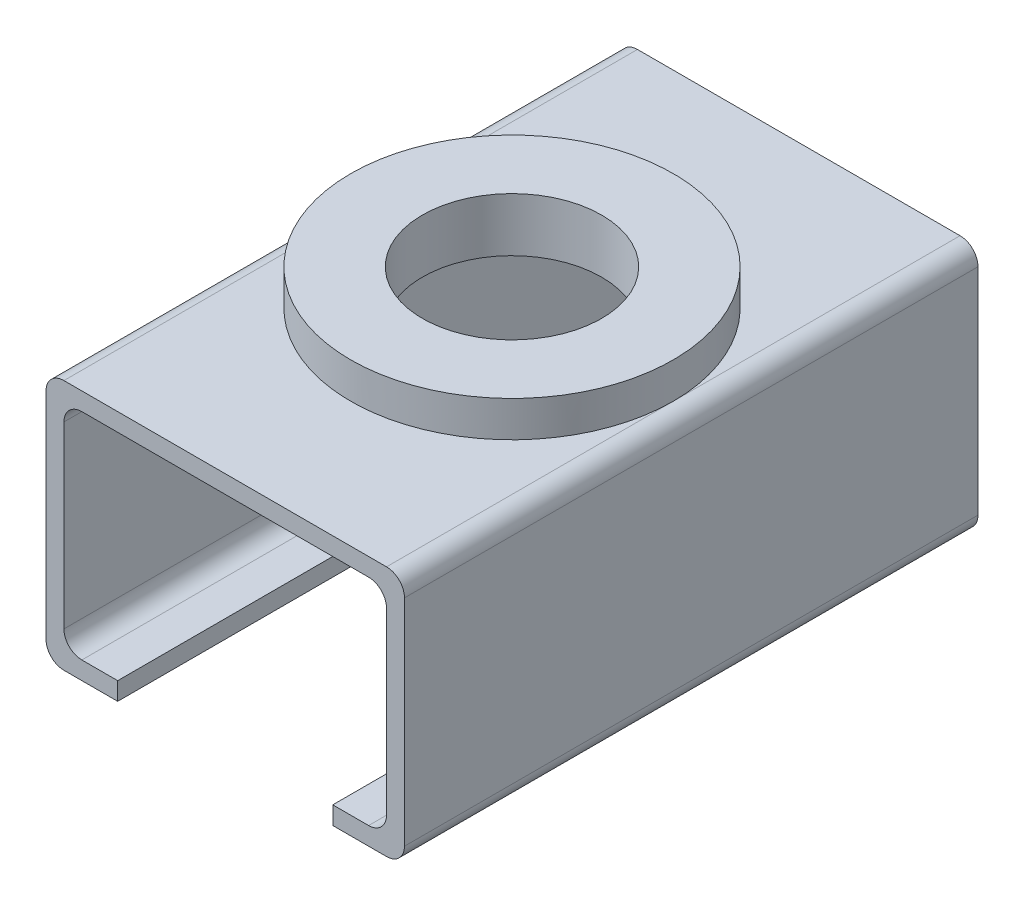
ISO-10303-21;
HEADER;
FILE_DESCRIPTION(('STEP AP214'),'2;1');
FILE_NAME('part.step','',(''),(''),'','','');
FILE_SCHEMA(('AUTOMOTIVE_DESIGN { 1 0 10303 214 1 1 1 1 }'));
ENDSEC;
DATA;
#1=APPLICATION_CONTEXT('core data for automotive mechanical design processes');
#2=APPLICATION_PROTOCOL_DEFINITION('international standard','automotive_design',2000,#1);
#3=PRODUCT_CONTEXT('',#1,'mechanical');
#4=PRODUCT('Part','Part','',(#3));
#5=PRODUCT_RELATED_PRODUCT_CATEGORY('part','',(#4));
#6=PRODUCT_DEFINITION_FORMATION('','',#4);
#7=PRODUCT_DEFINITION_CONTEXT('part definition',#1,'design');
#8=PRODUCT_DEFINITION('design','',#6,#7);
#9=PRODUCT_DEFINITION_SHAPE('','',#8);
#10=(LENGTH_UNIT() NAMED_UNIT(*) SI_UNIT(.MILLI.,.METRE.));
#11=(NAMED_UNIT(*) PLANE_ANGLE_UNIT() SI_UNIT($,.RADIAN.));
#12=(NAMED_UNIT(*) SI_UNIT($,.STERADIAN.) SOLID_ANGLE_UNIT());
#13=UNCERTAINTY_MEASURE_WITH_UNIT(LENGTH_MEASURE(1.E-05),#10,'distance_accuracy_value','');
#14=(GEOMETRIC_REPRESENTATION_CONTEXT(3) GLOBAL_UNCERTAINTY_ASSIGNED_CONTEXT((#13)) GLOBAL_UNIT_ASSIGNED_CONTEXT((#10,
#11,#12)) REPRESENTATION_CONTEXT('',''));
#15=CARTESIAN_POINT('',(0.,0.,0.));
#16=DIRECTION('',(0.,0.,1.));
#17=DIRECTION('',(1.,0.,0.));
#18=AXIS2_PLACEMENT_3D('',#15,#16,#17);
#19=CARTESIAN_POINT('',(-8.99999999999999,14.,16.));
#20=DIRECTION('',(0.,-1.,0.));
#21=DIRECTION('',(0.,0.,-1.));
#22=AXIS2_PLACEMENT_3D('',#19,#20,#21);
#23=PLANE('',#22);
#24=CARTESIAN_POINT('',(0.,14.,0.));
#25=DIRECTION('',(0.,1.,0.));
#26=DIRECTION('',(0.,0.,1.));
#27=AXIS2_PLACEMENT_3D('',#24,#25,#26);
#28=CIRCLE('',#27,8.99999999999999);
#29=CARTESIAN_POINT('',(-9.,14.,0.));
#30=VERTEX_POINT('',#29);
#31=CARTESIAN_POINT('',(8.99999999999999,14.,0.));
#32=VERTEX_POINT('',#31);
#33=EDGE_CURVE('E193',#30,#32,#28,.T.);
#34=ORIENTED_EDGE('',*,*,#33,.F.);
#35=DIRECTION('',(0.,0.,-1.));
#36=VECTOR('',#35,1.);
#37=CARTESIAN_POINT('',(-8.99999999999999,14.,16.));
#38=LINE('',#37,#36);
#39=CARTESIAN_POINT('',(-8.99999999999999,14.,16.));
#40=VERTEX_POINT('',#39);
#41=EDGE_CURVE('E174',#40,#30,#38,.T.);
#42=ORIENTED_EDGE('',*,*,#41,.F.);
#43=DIRECTION('',(-1.,0.,0.));
#44=VECTOR('',#43,1.);
#45=CARTESIAN_POINT('',(-8.99999999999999,14.,16.));
#46=LINE('',#45,#44);
#47=CARTESIAN_POINT('',(8.99999999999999,14.,16.));
#48=VERTEX_POINT('',#47);
#49=EDGE_CURVE('E293',#48,#40,#46,.T.);
#50=ORIENTED_EDGE('',*,*,#49,.F.);
#51=DIRECTION('',(0.,0.,-1.));
#52=VECTOR('',#51,1.);
#53=CARTESIAN_POINT('',(8.99999999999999,14.,16.));
#54=LINE('',#53,#52);
#55=EDGE_CURVE('E195',#48,#32,#54,.T.);
#56=ORIENTED_EDGE('',*,*,#55,.T.);
#57=EDGE_LOOP('',(#34,#42,#50,#56));
#58=FACE_BOUND('',#57,.T.);
#59=ADVANCED_FACE('F30',(#58),#23,.F.);
#60=EDGE_CURVE('E45',#32,#30,#28,.T.);
#61=ORIENTED_EDGE('',*,*,#60,.F.);
#62=CARTESIAN_POINT('',(8.99999999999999,14.,-16.));
#63=VERTEX_POINT('',#62);
#64=EDGE_CURVE('E184',#32,#63,#54,.T.);
#65=ORIENTED_EDGE('',*,*,#64,.T.);
#66=DIRECTION('',(-1.,0.,0.));
#67=VECTOR('',#66,1.);
#68=CARTESIAN_POINT('',(-8.99999999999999,14.,-16.));
#69=LINE('',#68,#67);
#70=CARTESIAN_POINT('',(-8.99999999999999,14.,-16.));
#71=VERTEX_POINT('',#70);
#72=EDGE_CURVE('E189',#63,#71,#69,.T.);
#73=ORIENTED_EDGE('',*,*,#72,.T.);
#74=EDGE_CURVE('E177',#30,#71,#38,.T.);
#75=ORIENTED_EDGE('',*,*,#74,.F.);
#76=EDGE_LOOP('',(#61,#65,#73,#75));
#77=FACE_BOUND('',#76,.T.);
#78=ADVANCED_FACE('F187',(#77),#23,.F.);
#79=CARTESIAN_POINT('',(-6.,1.,16.));
#80=DIRECTION('',(-1.,0.,0.));
#81=DIRECTION('',(0.,0.,1.));
#82=AXIS2_PLACEMENT_3D('',#79,#80,#81);
#83=PLANE('',#82);
#84=DIRECTION('',(0.,0.,-1.));
#85=VECTOR('',#84,1.);
#86=CARTESIAN_POINT('',(-6.,0.,16.));
#87=LINE('',#86,#85);
#88=CARTESIAN_POINT('',(-6.,0.,16.));
#89=VERTEX_POINT('',#88);
#90=CARTESIAN_POINT('',(-6.,0.,-16.));
#91=VERTEX_POINT('',#90);
#92=EDGE_CURVE('E301',#89,#91,#87,.T.);
#93=ORIENTED_EDGE('',*,*,#92,.T.);
#94=DIRECTION('',(0.,1.,0.));
#95=VECTOR('',#94,1.);
#96=CARTESIAN_POINT('',(-6.,1.,-16.));
#97=LINE('',#96,#95);
#98=CARTESIAN_POINT('',(-6.,1.,-16.));
#99=VERTEX_POINT('',#98);
#100=EDGE_CURVE('E202',#91,#99,#97,.T.);
#101=ORIENTED_EDGE('',*,*,#100,.T.);
#102=DIRECTION('',(0.,0.,-1.));
#103=VECTOR('',#102,1.);
#104=CARTESIAN_POINT('',(-6.,1.,16.));
#105=LINE('',#104,#103);
#106=CARTESIAN_POINT('',(-6.,1.,16.));
#107=VERTEX_POINT('',#106);
#108=EDGE_CURVE('E11',#107,#99,#105,.T.);
#109=ORIENTED_EDGE('',*,*,#108,.F.);
#110=DIRECTION('',(0.,1.,0.));
#111=VECTOR('',#110,1.);
#112=CARTESIAN_POINT('',(-6.,1.,16.));
#113=LINE('',#112,#111);
#114=EDGE_CURVE('E263',#89,#107,#113,.T.);
#115=ORIENTED_EDGE('',*,*,#114,.F.);
#116=EDGE_LOOP('',(#93,#101,#109,#115));
#117=FACE_BOUND('',#116,.T.);
#118=ADVANCED_FACE('F32',(#117),#83,.F.);
#119=CARTESIAN_POINT('',(-6.,1.,16.));
#120=DIRECTION('',(0.,-1.,0.));
#121=DIRECTION('',(1.,0.,0.));
#122=AXIS2_PLACEMENT_3D('',#119,#120,#121);
#123=PLANE('',#122);
#124=ORIENTED_EDGE('',*,*,#108,.T.);
#125=DIRECTION('',(-1.,0.,0.));
#126=VECTOR('',#125,1.);
#127=CARTESIAN_POINT('',(-6.,1.,-16.));
#128=LINE('',#127,#126);
#129=CARTESIAN_POINT('',(-7.99999999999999,1.,-16.));
#130=VERTEX_POINT('',#129);
#131=EDGE_CURVE('E209',#99,#130,#128,.T.);
#132=ORIENTED_EDGE('',*,*,#131,.T.);
#133=DIRECTION('',(0.,0.,-1.));
#134=VECTOR('',#133,1.);
#135=CARTESIAN_POINT('',(-7.99999999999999,1.,16.));
#136=LINE('',#135,#134);
#137=CARTESIAN_POINT('',(-7.99999999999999,1.,16.));
#138=VERTEX_POINT('',#137);
#139=EDGE_CURVE('E38',#138,#130,#136,.T.);
#140=ORIENTED_EDGE('',*,*,#139,.F.);
#141=DIRECTION('',(-1.,0.,0.));
#142=VECTOR('',#141,1.);
#143=CARTESIAN_POINT('',(-6.,1.,16.));
#144=LINE('',#143,#142);
#145=EDGE_CURVE('E265',#107,#138,#144,.T.);
#146=ORIENTED_EDGE('',*,*,#145,.F.);
#147=EDGE_LOOP('',(#124,#132,#140,#146));
#148=FACE_BOUND('',#147,.T.);
#149=ADVANCED_FACE('F345',(#148),#123,.F.);
#150=CARTESIAN_POINT('',(-8.,2.,16.));
#151=DIRECTION('',(0.,0.,-1.));
#152=DIRECTION('',(-1.,0.,0.));
#153=AXIS2_PLACEMENT_3D('',#150,#151,#152);
#154=CYLINDRICAL_SURFACE('',#153,1.);
#155=ORIENTED_EDGE('',*,*,#139,.T.);
#156=CARTESIAN_POINT('',(-8.,2.,-16.));
#157=DIRECTION('',(0.,0.,-1.));
#158=DIRECTION('',(1.,0.,0.));
#159=AXIS2_PLACEMENT_3D('',#156,#157,#158);
#160=CIRCLE('',#159,1.);
#161=CARTESIAN_POINT('',(-9.,2.00000000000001,-16.));
#162=VERTEX_POINT('',#161);
#163=EDGE_CURVE('E212',#130,#162,#160,.T.);
#164=ORIENTED_EDGE('',*,*,#163,.T.);
#165=DIRECTION('',(0.,0.,-1.));
#166=VECTOR('',#165,1.);
#167=CARTESIAN_POINT('',(-9.,2.00000000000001,16.));
#168=LINE('',#167,#166);
#169=CARTESIAN_POINT('',(-9.,2.00000000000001,16.));
#170=VERTEX_POINT('',#169);
#171=EDGE_CURVE('E331',#170,#162,#168,.T.);
#172=ORIENTED_EDGE('',*,*,#171,.F.);
#173=CARTESIAN_POINT('',(-8.,2.,16.));
#174=DIRECTION('',(0.,0.,-1.));
#175=DIRECTION('',(1.,0.,0.));
#176=AXIS2_PLACEMENT_3D('',#173,#174,#175);
#177=CIRCLE('',#176,1.);
#178=EDGE_CURVE('E267',#138,#170,#177,.T.);
#179=ORIENTED_EDGE('',*,*,#178,.F.);
#180=EDGE_LOOP('',(#155,#164,#172,#179));
#181=FACE_BOUND('',#180,.T.);
#182=ADVANCED_FACE('F336',(#181),#154,.F.);
#183=CARTESIAN_POINT('',(-9.,2.00000000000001,16.));
#184=DIRECTION('',(-1.,0.,0.));
#185=DIRECTION('',(0.,0.,1.));
#186=AXIS2_PLACEMENT_3D('',#183,#184,#185);
#187=PLANE('',#186);
#188=ORIENTED_EDGE('',*,*,#171,.T.);
#189=DIRECTION('',(0.,1.,0.));
#190=VECTOR('',#189,1.);
#191=CARTESIAN_POINT('',(-9.,2.00000000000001,-16.));
#192=LINE('',#191,#190);
#193=CARTESIAN_POINT('',(-9.,12.,-16.));
#194=VERTEX_POINT('',#193);
#195=EDGE_CURVE('E215',#162,#194,#192,.T.);
#196=ORIENTED_EDGE('',*,*,#195,.T.);
#197=DIRECTION('',(0.,0.,-1.));
#198=VECTOR('',#197,1.);
#199=CARTESIAN_POINT('',(-9.,12.,16.));
#200=LINE('',#199,#198);
#201=CARTESIAN_POINT('',(-9.,12.,16.));
#202=VERTEX_POINT('',#201);
#203=EDGE_CURVE('E329',#202,#194,#200,.T.);
#204=ORIENTED_EDGE('',*,*,#203,.F.);
#205=DIRECTION('',(0.,1.,0.));
#206=VECTOR('',#205,1.);
#207=CARTESIAN_POINT('',(-9.,2.00000000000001,16.));
#208=LINE('',#207,#206);
#209=EDGE_CURVE('E269',#170,#202,#208,.T.);
#210=ORIENTED_EDGE('',*,*,#209,.F.);
#211=EDGE_LOOP('',(#188,#196,#204,#210));
#212=FACE_BOUND('',#211,.T.);
#213=ADVANCED_FACE('F418',(#212),#187,.F.);
#214=CARTESIAN_POINT('',(-8.,12.,16.));
#215=DIRECTION('',(0.,0.,-1.));
#216=DIRECTION('',(-1.,0.,0.));
#217=AXIS2_PLACEMENT_3D('',#214,#215,#216);
#218=CYLINDRICAL_SURFACE('',#217,0.999999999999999);
#219=ORIENTED_EDGE('',*,*,#203,.T.);
#220=CARTESIAN_POINT('',(-8.,12.,-16.));
#221=DIRECTION('',(0.,0.,-1.));
#222=DIRECTION('',(-1.,0.,0.));
#223=AXIS2_PLACEMENT_3D('',#220,#221,#222);
#224=CIRCLE('',#223,0.999999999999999);
#225=CARTESIAN_POINT('',(-7.99999999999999,13.,-16.));
#226=VERTEX_POINT('',#225);
#227=EDGE_CURVE('E218',#194,#226,#224,.T.);
#228=ORIENTED_EDGE('',*,*,#227,.T.);
#229=DIRECTION('',(0.,0.,-1.));
#230=VECTOR('',#229,1.);
#231=CARTESIAN_POINT('',(-7.99999999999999,13.,16.));
#232=LINE('',#231,#230);
#233=CARTESIAN_POINT('',(-7.99999999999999,13.,16.));
#234=VERTEX_POINT('',#233);
#235=EDGE_CURVE('E327',#234,#226,#232,.T.);
#236=ORIENTED_EDGE('',*,*,#235,.F.);
#237=CARTESIAN_POINT('',(-8.,12.,16.));
#238=DIRECTION('',(0.,0.,-1.));
#239=DIRECTION('',(-1.,0.,0.));
#240=AXIS2_PLACEMENT_3D('',#237,#238,#239);
#241=CIRCLE('',#240,0.999999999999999);
#242=EDGE_CURVE('E271',#202,#234,#241,.T.);
#243=ORIENTED_EDGE('',*,*,#242,.F.);
#244=EDGE_LOOP('',(#219,#228,#236,#243));
#245=FACE_BOUND('',#244,.T.);
#246=ADVANCED_FACE('F413',(#245),#218,.F.);
#247=CARTESIAN_POINT('',(-7.99999999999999,13.,16.));
#248=DIRECTION('',(0.,1.,0.));
#249=DIRECTION('',(0.,0.,1.));
#250=AXIS2_PLACEMENT_3D('',#247,#248,#249);
#251=PLANE('',#250);
#252=CARTESIAN_POINT('',(0.,13.,0.));
#253=DIRECTION('',(0.,-1.,0.));
#254=DIRECTION('',(0.,0.,-1.));
#255=AXIS2_PLACEMENT_3D('',#252,#253,#254);
#256=CIRCLE('',#255,5.);
#257=CARTESIAN_POINT('',(0.,13.,-5.));
#258=VERTEX_POINT('',#257);
#259=EDGE_CURVE('E538',#258,#258,#256,.T.);
#260=ORIENTED_EDGE('',*,*,#259,.F.);
#261=EDGE_LOOP('',(#260));
#262=FACE_BOUND('',#261,.T.);
#263=ORIENTED_EDGE('',*,*,#235,.T.);
#264=DIRECTION('',(1.,0.,0.));
#265=VECTOR('',#264,1.);
#266=CARTESIAN_POINT('',(-7.99999999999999,13.,-16.));
#267=LINE('',#266,#265);
#268=CARTESIAN_POINT('',(7.99999999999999,13.,-16.));
#269=VERTEX_POINT('',#268);
#270=EDGE_CURVE('E221',#226,#269,#267,.T.);
#271=ORIENTED_EDGE('',*,*,#270,.T.);
#272=DIRECTION('',(0.,0.,-1.));
#273=VECTOR('',#272,1.);
#274=CARTESIAN_POINT('',(7.99999999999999,13.,16.));
#275=LINE('',#274,#273);
#276=CARTESIAN_POINT('',(7.99999999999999,13.,16.));
#277=VERTEX_POINT('',#276);
#278=EDGE_CURVE('E325',#277,#269,#275,.T.);
#279=ORIENTED_EDGE('',*,*,#278,.F.);
#280=DIRECTION('',(1.,0.,0.));
#281=VECTOR('',#280,1.);
#282=CARTESIAN_POINT('',(-7.99999999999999,13.,16.));
#283=LINE('',#282,#281);
#284=EDGE_CURVE('E273',#234,#277,#283,.T.);
#285=ORIENTED_EDGE('',*,*,#284,.F.);
#286=EDGE_LOOP('',(#263,#271,#279,#285));
#287=FACE_BOUND('',#286,.T.);
#288=ADVANCED_FACE('F410',(#262,#287),#251,.F.);
#289=CARTESIAN_POINT('',(8.,12.,16.));
#290=DIRECTION('',(0.,0.,-1.));
#291=DIRECTION('',(-1.,0.,0.));
#292=AXIS2_PLACEMENT_3D('',#289,#290,#291);
#293=CYLINDRICAL_SURFACE('',#292,1.);
#294=ORIENTED_EDGE('',*,*,#278,.T.);
#295=CARTESIAN_POINT('',(8.,12.,-16.));
#296=DIRECTION('',(0.,0.,-1.));
#297=DIRECTION('',(1.,0.,0.));
#298=AXIS2_PLACEMENT_3D('',#295,#296,#297);
#299=CIRCLE('',#298,1.);
#300=CARTESIAN_POINT('',(9.,12.,-16.));
#301=VERTEX_POINT('',#300);
#302=EDGE_CURVE('E224',#269,#301,#299,.T.);
#303=ORIENTED_EDGE('',*,*,#302,.T.);
#304=DIRECTION('',(0.,0.,-1.));
#305=VECTOR('',#304,1.);
#306=CARTESIAN_POINT('',(9.,12.,16.));
#307=LINE('',#306,#305);
#308=CARTESIAN_POINT('',(9.,12.,16.));
#309=VERTEX_POINT('',#308);
#310=EDGE_CURVE('E323',#309,#301,#307,.T.);
#311=ORIENTED_EDGE('',*,*,#310,.F.);
#312=CARTESIAN_POINT('',(8.,12.,16.));
#313=DIRECTION('',(0.,0.,-1.));
#314=DIRECTION('',(1.,0.,0.));
#315=AXIS2_PLACEMENT_3D('',#312,#313,#314);
#316=CIRCLE('',#315,1.);
#317=EDGE_CURVE('E275',#277,#309,#316,.T.);
#318=ORIENTED_EDGE('',*,*,#317,.F.);
#319=EDGE_LOOP('',(#294,#303,#311,#318));
#320=FACE_BOUND('',#319,.T.);
#321=ADVANCED_FACE('F405',(#320),#293,.F.);
#322=CARTESIAN_POINT('',(9.,12.,16.));
#323=DIRECTION('',(1.,0.,0.));
#324=DIRECTION('',(0.,1.,0.));
#325=AXIS2_PLACEMENT_3D('',#322,#323,#324);
#326=PLANE('',#325);
#327=ORIENTED_EDGE('',*,*,#310,.T.);
#328=DIRECTION('',(0.,-1.,0.));
#329=VECTOR('',#328,1.);
#330=CARTESIAN_POINT('',(9.,12.,-16.));
#331=LINE('',#330,#329);
#332=CARTESIAN_POINT('',(9.,2.00000000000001,-16.));
#333=VERTEX_POINT('',#332);
#334=EDGE_CURVE('E227',#301,#333,#331,.T.);
#335=ORIENTED_EDGE('',*,*,#334,.T.);
#336=DIRECTION('',(0.,0.,-1.));
#337=VECTOR('',#336,1.);
#338=CARTESIAN_POINT('',(9.,2.00000000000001,16.));
#339=LINE('',#338,#337);
#340=CARTESIAN_POINT('',(9.,2.00000000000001,16.));
#341=VERTEX_POINT('',#340);
#342=EDGE_CURVE('E321',#341,#333,#339,.T.);
#343=ORIENTED_EDGE('',*,*,#342,.F.);
#344=DIRECTION('',(0.,-1.,0.));
#345=VECTOR('',#344,1.);
#346=CARTESIAN_POINT('',(9.,12.,16.));
#347=LINE('',#346,#345);
#348=EDGE_CURVE('E277',#309,#341,#347,.T.);
#349=ORIENTED_EDGE('',*,*,#348,.F.);
#350=EDGE_LOOP('',(#327,#335,#343,#349));
#351=FACE_BOUND('',#350,.T.);
#352=ADVANCED_FACE('F400',(#351),#326,.F.);
#353=CARTESIAN_POINT('',(8.,2.,16.));
#354=DIRECTION('',(0.,0.,-1.));
#355=DIRECTION('',(-1.,0.,0.));
#356=AXIS2_PLACEMENT_3D('',#353,#354,#355);
#357=CYLINDRICAL_SURFACE('',#356,1.);
#358=ORIENTED_EDGE('',*,*,#342,.T.);
#359=CARTESIAN_POINT('',(8.,2.,-16.));
#360=DIRECTION('',(0.,0.,-1.));
#361=DIRECTION('',(1.,0.,0.));
#362=AXIS2_PLACEMENT_3D('',#359,#360,#361);
#363=CIRCLE('',#362,1.);
#364=CARTESIAN_POINT('',(7.99999999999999,1.,-16.));
#365=VERTEX_POINT('',#364);
#366=EDGE_CURVE('E230',#333,#365,#363,.T.);
#367=ORIENTED_EDGE('',*,*,#366,.T.);
#368=DIRECTION('',(0.,0.,-1.));
#369=VECTOR('',#368,1.);
#370=CARTESIAN_POINT('',(7.99999999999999,1.,16.));
#371=LINE('',#370,#369);
#372=CARTESIAN_POINT('',(7.99999999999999,1.,16.));
#373=VERTEX_POINT('',#372);
#374=EDGE_CURVE('E319',#373,#365,#371,.T.);
#375=ORIENTED_EDGE('',*,*,#374,.F.);
#376=CARTESIAN_POINT('',(8.,2.,16.));
#377=DIRECTION('',(0.,0.,-1.));
#378=DIRECTION('',(1.,0.,0.));
#379=AXIS2_PLACEMENT_3D('',#376,#377,#378);
#380=CIRCLE('',#379,1.);
#381=EDGE_CURVE('E279',#341,#373,#380,.T.);
#382=ORIENTED_EDGE('',*,*,#381,.F.);
#383=EDGE_LOOP('',(#358,#367,#375,#382));
#384=FACE_BOUND('',#383,.T.);
#385=ADVANCED_FACE('F395',(#384),#357,.F.);
#386=CARTESIAN_POINT('',(7.99999999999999,1.,16.));
#387=DIRECTION('',(0.,-1.,0.));
#388=DIRECTION('',(1.,0.,0.));
#389=AXIS2_PLACEMENT_3D('',#386,#387,#388);
#390=PLANE('',#389);
#391=ORIENTED_EDGE('',*,*,#374,.T.);
#392=DIRECTION('',(-1.,0.,0.));
#393=VECTOR('',#392,1.);
#394=CARTESIAN_POINT('',(7.99999999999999,1.,-16.));
#395=LINE('',#394,#393);
#396=CARTESIAN_POINT('',(6.,1.,-16.));
#397=VERTEX_POINT('',#396);
#398=EDGE_CURVE('E233',#365,#397,#395,.T.);
#399=ORIENTED_EDGE('',*,*,#398,.T.);
#400=DIRECTION('',(0.,0.,-1.));
#401=VECTOR('',#400,1.);
#402=CARTESIAN_POINT('',(6.,1.,16.));
#403=LINE('',#402,#401);
#404=CARTESIAN_POINT('',(6.,1.,16.));
#405=VERTEX_POINT('',#404);
#406=EDGE_CURVE('E317',#405,#397,#403,.T.);
#407=ORIENTED_EDGE('',*,*,#406,.F.);
#408=DIRECTION('',(-1.,0.,0.));
#409=VECTOR('',#408,1.);
#410=CARTESIAN_POINT('',(7.99999999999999,1.,16.));
#411=LINE('',#410,#409);
#412=EDGE_CURVE('E281',#373,#405,#411,.T.);
#413=ORIENTED_EDGE('',*,*,#412,.F.);
#414=EDGE_LOOP('',(#391,#399,#407,#413));
#415=FACE_BOUND('',#414,.T.);
#416=ADVANCED_FACE('F390',(#415),#390,.F.);
#417=CARTESIAN_POINT('',(6.,1.,16.));
#418=DIRECTION('',(1.,0.,0.));
#419=DIRECTION('',(0.,0.,-1.));
#420=AXIS2_PLACEMENT_3D('',#417,#418,#419);
#421=PLANE('',#420);
#422=ORIENTED_EDGE('',*,*,#406,.T.);
#423=DIRECTION('',(0.,-1.,0.));
#424=VECTOR('',#423,1.);
#425=CARTESIAN_POINT('',(6.,1.,-16.));
#426=LINE('',#425,#424);
#427=CARTESIAN_POINT('',(6.,0.,-16.));
#428=VERTEX_POINT('',#427);
#429=EDGE_CURVE('E236',#397,#428,#426,.T.);
#430=ORIENTED_EDGE('',*,*,#429,.T.);
#431=DIRECTION('',(0.,0.,-1.));
#432=VECTOR('',#431,1.);
#433=CARTESIAN_POINT('',(6.,0.,16.));
#434=LINE('',#433,#432);
#435=CARTESIAN_POINT('',(6.,0.,16.));
#436=VERTEX_POINT('',#435);
#437=EDGE_CURVE('E315',#436,#428,#434,.T.);
#438=ORIENTED_EDGE('',*,*,#437,.F.);
#439=DIRECTION('',(0.,-1.,0.));
#440=VECTOR('',#439,1.);
#441=CARTESIAN_POINT('',(6.,1.,16.));
#442=LINE('',#441,#440);
#443=EDGE_CURVE('E283',#405,#436,#442,.T.);
#444=ORIENTED_EDGE('',*,*,#443,.F.);
#445=EDGE_LOOP('',(#422,#430,#438,#444));
#446=FACE_BOUND('',#445,.T.);
#447=ADVANCED_FACE('F385',(#446),#421,.F.);
#448=CARTESIAN_POINT('',(9.,0.,16.));
#449=DIRECTION('',(0.,1.,0.));
#450=DIRECTION('',(-1.,0.,0.));
#451=AXIS2_PLACEMENT_3D('',#448,#449,#450);
#452=PLANE('',#451);
#453=ORIENTED_EDGE('',*,*,#437,.T.);
#454=DIRECTION('',(1.,0.,0.));
#455=VECTOR('',#454,1.);
#456=CARTESIAN_POINT('',(9.,0.,-16.));
#457=LINE('',#456,#455);
#458=CARTESIAN_POINT('',(9.,0.,-16.));
#459=VERTEX_POINT('',#458);
#460=EDGE_CURVE('E239',#428,#459,#457,.T.);
#461=ORIENTED_EDGE('',*,*,#460,.T.);
#462=DIRECTION('',(0.,0.,-1.));
#463=VECTOR('',#462,1.);
#464=CARTESIAN_POINT('',(9.,0.,16.));
#465=LINE('',#464,#463);
#466=CARTESIAN_POINT('',(9.,0.,16.));
#467=VERTEX_POINT('',#466);
#468=EDGE_CURVE('E313',#467,#459,#465,.T.);
#469=ORIENTED_EDGE('',*,*,#468,.F.);
#470=DIRECTION('',(1.,0.,0.));
#471=VECTOR('',#470,1.);
#472=CARTESIAN_POINT('',(9.,0.,16.));
#473=LINE('',#472,#471);
#474=EDGE_CURVE('E285',#436,#467,#473,.T.);
#475=ORIENTED_EDGE('',*,*,#474,.F.);
#476=EDGE_LOOP('',(#453,#461,#469,#475));
#477=FACE_BOUND('',#476,.T.);
#478=ADVANCED_FACE('F380',(#477),#452,.F.);
#479=CARTESIAN_POINT('',(9.,1.,16.));
#480=DIRECTION('',(0.,0.,-1.));
#481=DIRECTION('',(-1.,0.,0.));
#482=AXIS2_PLACEMENT_3D('',#479,#480,#481);
#483=CYLINDRICAL_SURFACE('',#482,1.);
#484=ORIENTED_EDGE('',*,*,#468,.T.);
#485=CARTESIAN_POINT('',(9.,1.,-16.));
#486=DIRECTION('',(0.,0.,1.));
#487=DIRECTION('',(1.,0.,0.));
#488=AXIS2_PLACEMENT_3D('',#485,#486,#487);
#489=CIRCLE('',#488,1.);
#490=CARTESIAN_POINT('',(10.,1.00000000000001,-16.));
#491=VERTEX_POINT('',#490);
#492=EDGE_CURVE('E242',#459,#491,#489,.T.);
#493=ORIENTED_EDGE('',*,*,#492,.T.);
#494=DIRECTION('',(0.,0.,-1.));
#495=VECTOR('',#494,1.);
#496=CARTESIAN_POINT('',(10.,1.00000000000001,16.));
#497=LINE('',#496,#495);
#498=CARTESIAN_POINT('',(10.,1.00000000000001,16.));
#499=VERTEX_POINT('',#498);
#500=EDGE_CURVE('E311',#499,#491,#497,.T.);
#501=ORIENTED_EDGE('',*,*,#500,.F.);
#502=CARTESIAN_POINT('',(9.,1.,16.));
#503=DIRECTION('',(0.,0.,1.));
#504=DIRECTION('',(1.,0.,0.));
#505=AXIS2_PLACEMENT_3D('',#502,#503,#504);
#506=CIRCLE('',#505,1.);
#507=EDGE_CURVE('E287',#467,#499,#506,.T.);
#508=ORIENTED_EDGE('',*,*,#507,.F.);
#509=EDGE_LOOP('',(#484,#493,#501,#508));
#510=FACE_BOUND('',#509,.T.);
#511=ADVANCED_FACE('F375',(#510),#483,.T.);
#512=CARTESIAN_POINT('',(10.,13.,16.));
#513=DIRECTION('',(-1.,0.,0.));
#514=DIRECTION('',(0.,-1.,0.));
#515=AXIS2_PLACEMENT_3D('',#512,#513,#514);
#516=PLANE('',#515);
#517=ORIENTED_EDGE('',*,*,#500,.T.);
#518=DIRECTION('',(0.,1.,0.));
#519=VECTOR('',#518,1.);
#520=CARTESIAN_POINT('',(10.,13.,-16.));
#521=LINE('',#520,#519);
#522=CARTESIAN_POINT('',(10.,13.,-16.));
#523=VERTEX_POINT('',#522);
#524=EDGE_CURVE('E245',#491,#523,#521,.T.);
#525=ORIENTED_EDGE('',*,*,#524,.T.);
#526=DIRECTION('',(0.,0.,-1.));
#527=VECTOR('',#526,1.);
#528=CARTESIAN_POINT('',(10.,13.,16.));
#529=LINE('',#528,#527);
#530=CARTESIAN_POINT('',(10.,13.,16.));
#531=VERTEX_POINT('',#530);
#532=EDGE_CURVE('E309',#531,#523,#529,.T.);
#533=ORIENTED_EDGE('',*,*,#532,.F.);
#534=DIRECTION('',(0.,1.,0.));
#535=VECTOR('',#534,1.);
#536=CARTESIAN_POINT('',(10.,13.,16.));
#537=LINE('',#536,#535);
#538=EDGE_CURVE('E289',#499,#531,#537,.T.);
#539=ORIENTED_EDGE('',*,*,#538,.F.);
#540=EDGE_LOOP('',(#517,#525,#533,#539));
#541=FACE_BOUND('',#540,.T.);
#542=ADVANCED_FACE('F370',(#541),#516,.F.);
#543=CARTESIAN_POINT('',(9.,13.,16.));
#544=DIRECTION('',(0.,0.,-1.));
#545=DIRECTION('',(-1.,0.,0.));
#546=AXIS2_PLACEMENT_3D('',#543,#544,#545);
#547=CYLINDRICAL_SURFACE('',#546,1.);
#548=ORIENTED_EDGE('',*,*,#532,.T.);
#549=CARTESIAN_POINT('',(9.,13.,-16.));
#550=DIRECTION('',(0.,0.,1.));
#551=DIRECTION('',(1.,0.,0.));
#552=AXIS2_PLACEMENT_3D('',#549,#550,#551);
#553=CIRCLE('',#552,1.);
#554=EDGE_CURVE('E248',#523,#63,#553,.T.);
#555=ORIENTED_EDGE('',*,*,#554,.T.);
#556=ORIENTED_EDGE('',*,*,#64,.F.);
#557=ORIENTED_EDGE('',*,*,#55,.F.);
#558=CARTESIAN_POINT('',(9.,13.,16.));
#559=DIRECTION('',(0.,0.,1.));
#560=DIRECTION('',(1.,0.,0.));
#561=AXIS2_PLACEMENT_3D('',#558,#559,#560);
#562=CIRCLE('',#561,1.);
#563=EDGE_CURVE('E291',#531,#48,#562,.T.);
#564=ORIENTED_EDGE('',*,*,#563,.F.);
#565=EDGE_LOOP('',(#548,#555,#556,#557,#564));
#566=FACE_BOUND('',#565,.T.);
#567=ADVANCED_FACE('F365',(#566),#547,.T.);
#568=CARTESIAN_POINT('',(-9.,13.,16.));
#569=DIRECTION('',(0.,0.,-1.));
#570=DIRECTION('',(-1.,0.,0.));
#571=AXIS2_PLACEMENT_3D('',#568,#569,#570);
#572=CYLINDRICAL_SURFACE('',#571,0.999999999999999);
#573=ORIENTED_EDGE('',*,*,#41,.T.);
#574=ORIENTED_EDGE('',*,*,#74,.T.);
#575=CARTESIAN_POINT('',(-9.,13.,-16.));
#576=DIRECTION('',(0.,0.,1.));
#577=DIRECTION('',(-1.,0.,0.));
#578=AXIS2_PLACEMENT_3D('',#575,#576,#577);
#579=CIRCLE('',#578,0.999999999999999);
#580=CARTESIAN_POINT('',(-10.,13.,-16.));
#581=VERTEX_POINT('',#580);
#582=EDGE_CURVE('E252',#71,#581,#579,.T.);
#583=ORIENTED_EDGE('',*,*,#582,.T.);
#584=DIRECTION('',(0.,0.,-1.));
#585=VECTOR('',#584,1.);
#586=CARTESIAN_POINT('',(-10.,13.,16.));
#587=LINE('',#586,#585);
#588=CARTESIAN_POINT('',(-10.,13.,16.));
#589=VERTEX_POINT('',#588);
#590=EDGE_CURVE('E190',#589,#581,#587,.T.);
#591=ORIENTED_EDGE('',*,*,#590,.F.);
#592=CARTESIAN_POINT('',(-9.,13.,16.));
#593=DIRECTION('',(0.,0.,1.));
#594=DIRECTION('',(-1.,0.,0.));
#595=AXIS2_PLACEMENT_3D('',#592,#593,#594);
#596=CIRCLE('',#595,0.999999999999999);
#597=EDGE_CURVE('E180',#40,#589,#596,.T.);
#598=ORIENTED_EDGE('',*,*,#597,.F.);
#599=EDGE_LOOP('',(#573,#574,#583,#591,#598));
#600=FACE_BOUND('',#599,.T.);
#601=ADVANCED_FACE('F175',(#600),#572,.T.);
#602=CARTESIAN_POINT('',(-10.,1.00000000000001,16.));
#603=DIRECTION('',(1.,0.,0.));
#604=DIRECTION('',(0.,0.,-1.));
#605=AXIS2_PLACEMENT_3D('',#602,#603,#604);
#606=PLANE('',#605);
#607=ORIENTED_EDGE('',*,*,#590,.T.);
#608=DIRECTION('',(0.,-1.,0.));
#609=VECTOR('',#608,1.);
#610=CARTESIAN_POINT('',(-10.,1.00000000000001,-16.));
#611=LINE('',#610,#609);
#612=CARTESIAN_POINT('',(-10.,1.00000000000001,-16.));
#613=VERTEX_POINT('',#612);
#614=EDGE_CURVE('E254',#581,#613,#611,.T.);
#615=ORIENTED_EDGE('',*,*,#614,.T.);
#616=DIRECTION('',(0.,0.,-1.));
#617=VECTOR('',#616,1.);
#618=CARTESIAN_POINT('',(-10.,1.00000000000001,16.));
#619=LINE('',#618,#617);
#620=CARTESIAN_POINT('',(-10.,1.00000000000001,16.));
#621=VERTEX_POINT('',#620);
#622=EDGE_CURVE('E305',#621,#613,#619,.T.);
#623=ORIENTED_EDGE('',*,*,#622,.F.);
#624=DIRECTION('',(0.,-1.,0.));
#625=VECTOR('',#624,1.);
#626=CARTESIAN_POINT('',(-10.,1.00000000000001,16.));
#627=LINE('',#626,#625);
#628=EDGE_CURVE('E296',#589,#621,#627,.T.);
#629=ORIENTED_EDGE('',*,*,#628,.F.);
#630=EDGE_LOOP('',(#607,#615,#623,#629));
#631=FACE_BOUND('',#630,.T.);
#632=ADVANCED_FACE('F360',(#631),#606,.F.);
#633=CARTESIAN_POINT('',(-9.,1.,16.));
#634=DIRECTION('',(0.,0.,-1.));
#635=DIRECTION('',(-1.,0.,0.));
#636=AXIS2_PLACEMENT_3D('',#633,#634,#635);
#637=CYLINDRICAL_SURFACE('',#636,1.);
#638=ORIENTED_EDGE('',*,*,#622,.T.);
#639=CARTESIAN_POINT('',(-9.,1.,-16.));
#640=DIRECTION('',(0.,0.,1.));
#641=DIRECTION('',(1.,0.,0.));
#642=AXIS2_PLACEMENT_3D('',#639,#640,#641);
#643=CIRCLE('',#642,1.);
#644=CARTESIAN_POINT('',(-9.,0.,-16.));
#645=VERTEX_POINT('',#644);
#646=EDGE_CURVE('E257',#613,#645,#643,.T.);
#647=ORIENTED_EDGE('',*,*,#646,.T.);
#648=DIRECTION('',(0.,0.,-1.));
#649=VECTOR('',#648,1.);
#650=CARTESIAN_POINT('',(-9.,0.,16.));
#651=LINE('',#650,#649);
#652=CARTESIAN_POINT('',(-9.,0.,16.));
#653=VERTEX_POINT('',#652);
#654=EDGE_CURVE('E303',#653,#645,#651,.T.);
#655=ORIENTED_EDGE('',*,*,#654,.F.);
#656=CARTESIAN_POINT('',(-9.,1.,16.));
#657=DIRECTION('',(0.,0.,1.));
#658=DIRECTION('',(1.,0.,0.));
#659=AXIS2_PLACEMENT_3D('',#656,#657,#658);
#660=CIRCLE('',#659,1.);
#661=EDGE_CURVE('E298',#621,#653,#660,.T.);
#662=ORIENTED_EDGE('',*,*,#661,.F.);
#663=EDGE_LOOP('',(#638,#647,#655,#662));
#664=FACE_BOUND('',#663,.T.);
#665=ADVANCED_FACE('F356',(#664),#637,.T.);
#666=CARTESIAN_POINT('',(-6.,0.,16.));
#667=DIRECTION('',(0.,1.,0.));
#668=DIRECTION('',(-1.,0.,0.));
#669=AXIS2_PLACEMENT_3D('',#666,#667,#668);
#670=PLANE('',#669);
#671=ORIENTED_EDGE('',*,*,#654,.T.);
#672=DIRECTION('',(1.,0.,0.));
#673=VECTOR('',#672,1.);
#674=CARTESIAN_POINT('',(-6.,0.,-16.));
#675=LINE('',#674,#673);
#676=EDGE_CURVE('E260',#645,#91,#675,.T.);
#677=ORIENTED_EDGE('',*,*,#676,.T.);
#678=ORIENTED_EDGE('',*,*,#92,.F.);
#679=DIRECTION('',(1.,0.,0.));
#680=VECTOR('',#679,1.);
#681=CARTESIAN_POINT('',(-6.,0.,16.));
#682=LINE('',#681,#680);
#683=EDGE_CURVE('E53',#653,#89,#682,.T.);
#684=ORIENTED_EDGE('',*,*,#683,.F.);
#685=EDGE_LOOP('',(#671,#677,#678,#684));
#686=FACE_BOUND('',#685,.T.);
#687=ADVANCED_FACE('F352',(#686),#670,.F.);
#688=CARTESIAN_POINT('',(-9.,1.,16.));
#689=DIRECTION('',(0.,0.,1.));
#690=DIRECTION('',(1.,0.,0.));
#691=AXIS2_PLACEMENT_3D('',#688,#689,#690);
#692=PLANE('',#691);
#693=ORIENTED_EDGE('',*,*,#114,.T.);
#694=ORIENTED_EDGE('',*,*,#145,.T.);
#695=ORIENTED_EDGE('',*,*,#178,.T.);
#696=ORIENTED_EDGE('',*,*,#209,.T.);
#697=ORIENTED_EDGE('',*,*,#242,.T.);
#698=ORIENTED_EDGE('',*,*,#284,.T.);
#699=ORIENTED_EDGE('',*,*,#317,.T.);
#700=ORIENTED_EDGE('',*,*,#348,.T.);
#701=ORIENTED_EDGE('',*,*,#381,.T.);
#702=ORIENTED_EDGE('',*,*,#412,.T.);
#703=ORIENTED_EDGE('',*,*,#443,.T.);
#704=ORIENTED_EDGE('',*,*,#474,.T.);
#705=ORIENTED_EDGE('',*,*,#507,.T.);
#706=ORIENTED_EDGE('',*,*,#538,.T.);
#707=ORIENTED_EDGE('',*,*,#563,.T.);
#708=ORIENTED_EDGE('',*,*,#49,.T.);
#709=ORIENTED_EDGE('',*,*,#597,.T.);
#710=ORIENTED_EDGE('',*,*,#628,.T.);
#711=ORIENTED_EDGE('',*,*,#661,.T.);
#712=ORIENTED_EDGE('',*,*,#683,.T.);
#713=EDGE_LOOP('',(#693,#694,#695,#696,#697,#698,#699,#700,#701,#702,#703,#704,#705,#706,#707,
#708,#709,#710,#711,#712));
#714=FACE_BOUND('',#713,.T.);
#715=ADVANCED_FACE('F419',(#714),#692,.T.);
#716=CARTESIAN_POINT('',(-9.,1.,-16.));
#717=DIRECTION('',(0.,0.,1.));
#718=DIRECTION('',(1.,0.,0.));
#719=AXIS2_PLACEMENT_3D('',#716,#717,#718);
#720=PLANE('',#719);
#721=ORIENTED_EDGE('',*,*,#100,.F.);
#722=ORIENTED_EDGE('',*,*,#676,.F.);
#723=ORIENTED_EDGE('',*,*,#646,.F.);
#724=ORIENTED_EDGE('',*,*,#614,.F.);
#725=ORIENTED_EDGE('',*,*,#582,.F.);
#726=ORIENTED_EDGE('',*,*,#72,.F.);
#727=ORIENTED_EDGE('',*,*,#554,.F.);
#728=ORIENTED_EDGE('',*,*,#524,.F.);
#729=ORIENTED_EDGE('',*,*,#492,.F.);
#730=ORIENTED_EDGE('',*,*,#460,.F.);
#731=ORIENTED_EDGE('',*,*,#429,.F.);
#732=ORIENTED_EDGE('',*,*,#398,.F.);
#733=ORIENTED_EDGE('',*,*,#366,.F.);
#734=ORIENTED_EDGE('',*,*,#334,.F.);
#735=ORIENTED_EDGE('',*,*,#302,.F.);
#736=ORIENTED_EDGE('',*,*,#270,.F.);
#737=ORIENTED_EDGE('',*,*,#227,.F.);
#738=ORIENTED_EDGE('',*,*,#195,.F.);
#739=ORIENTED_EDGE('',*,*,#163,.F.);
#740=ORIENTED_EDGE('',*,*,#131,.F.);
#741=EDGE_LOOP('',(#721,#722,#723,#724,#725,#726,#727,#728,#729,#730,#731,#732,#733,#734,#735,
#736,#737,#738,#739,#740));
#742=FACE_BOUND('',#741,.T.);
#743=ADVANCED_FACE('F343',(#742),#720,.F.);
#744=CARTESIAN_POINT('',(0.,16.,0.));
#745=DIRECTION('',(0.,-1.,0.));
#746=DIRECTION('',(0.,0.,-1.));
#747=AXIS2_PLACEMENT_3D('',#744,#745,#746);
#748=CYLINDRICAL_SURFACE('',#747,8.99999999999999);
#749=CARTESIAN_POINT('',(0.,16.,0.));
#750=DIRECTION('',(0.,1.,0.));
#751=DIRECTION('',(0.,0.,1.));
#752=AXIS2_PLACEMENT_3D('',#749,#750,#751);
#753=CIRCLE('',#752,8.99999999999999);
#754=CARTESIAN_POINT('',(0.,16.,8.99999999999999));
#755=VERTEX_POINT('',#754);
#756=EDGE_CURVE('E200',#755,#755,#753,.T.);
#757=ORIENTED_EDGE('',*,*,#756,.F.);
#758=EDGE_LOOP('',(#757));
#759=FACE_BOUND('',#758,.T.);
#760=ORIENTED_EDGE('',*,*,#60,.T.);
#761=ORIENTED_EDGE('',*,*,#33,.T.);
#762=EDGE_LOOP('',(#760,#761));
#763=FACE_BOUND('',#762,.T.);
#764=ADVANCED_FACE('F199',(#759,#763),#748,.T.);
#765=CARTESIAN_POINT('',(0.,16.,0.));
#766=DIRECTION('',(0.,1.,0.));
#767=DIRECTION('',(0.,0.,1.));
#768=AXIS2_PLACEMENT_3D('',#765,#766,#767);
#769=PLANE('',#768);
#770=CARTESIAN_POINT('',(0.,16.,0.));
#771=DIRECTION('',(0.,-1.,0.));
#772=DIRECTION('',(0.,0.,-1.));
#773=AXIS2_PLACEMENT_3D('',#770,#771,#772);
#774=CIRCLE('',#773,5.);
#775=CARTESIAN_POINT('',(0.,16.,-5.));
#776=VERTEX_POINT('',#775);
#777=EDGE_CURVE('E197',#776,#776,#774,.T.);
#778=ORIENTED_EDGE('',*,*,#777,.T.);
#779=EDGE_LOOP('',(#778));
#780=FACE_BOUND('',#779,.T.);
#781=ORIENTED_EDGE('',*,*,#756,.T.);
#782=EDGE_LOOP('',(#781));
#783=FACE_BOUND('',#782,.T.);
#784=ADVANCED_FACE('F501',(#780,#783),#769,.T.);
#785=CARTESIAN_POINT('',(0.,16.,0.));
#786=DIRECTION('',(0.,-1.,0.));
#787=DIRECTION('',(0.,0.,-1.));
#788=AXIS2_PLACEMENT_3D('',#785,#786,#787);
#789=CYLINDRICAL_SURFACE('',#788,5.);
#790=ORIENTED_EDGE('',*,*,#777,.F.);
#791=EDGE_LOOP('',(#790));
#792=FACE_BOUND('',#791,.T.);
#793=ORIENTED_EDGE('',*,*,#259,.T.);
#794=EDGE_LOOP('',(#793));
#795=FACE_BOUND('',#794,.T.);
#796=ADVANCED_FACE('F519',(#792,#795),#789,.F.);
#797=CLOSED_SHELL('',(#59,#78,#118,#149,#182,#213,#246,#288,#321,#352,#385,#416,#447,#478,#511,
#542,#567,#601,#632,#665,#687,#715,#743,#764,#784,#796));
#798=MANIFOLD_SOLID_BREP('B2',#797);
#799=ADVANCED_BREP_SHAPE_REPRESENTATION('',(#18,#798),#14);
#800=SHAPE_DEFINITION_REPRESENTATION(#9,#799);
ENDSEC;
END-ISO-10303-21;
